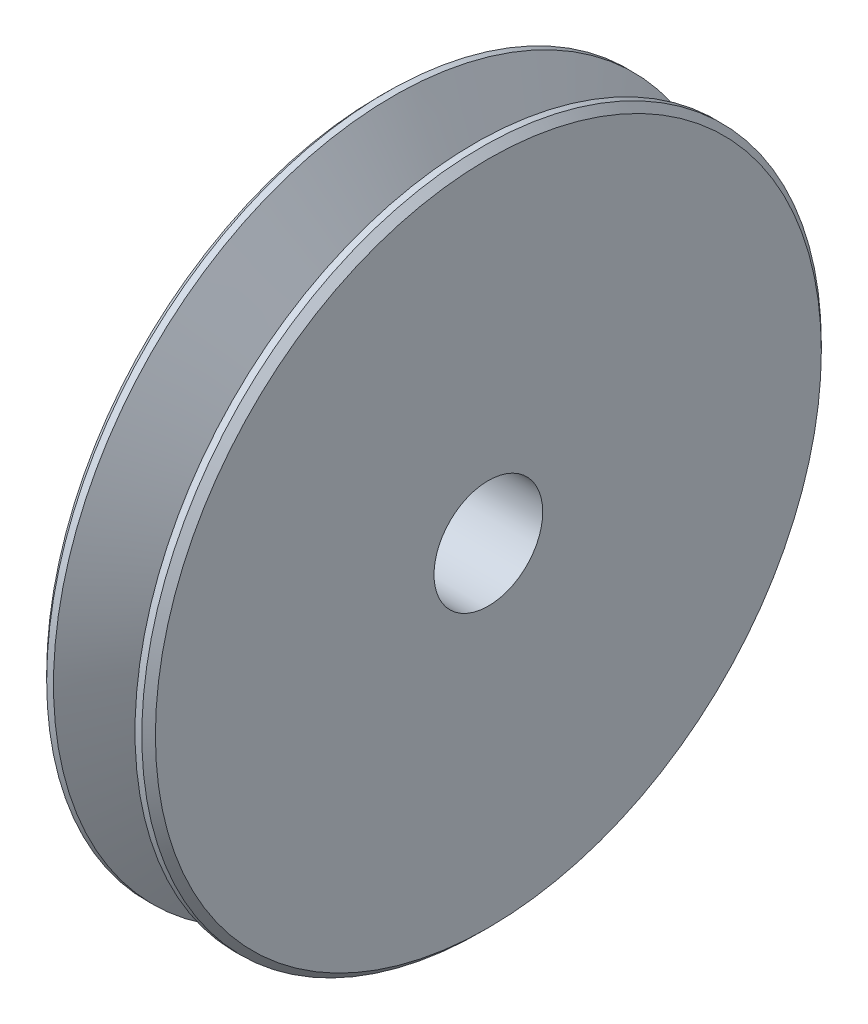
ISO-10303-21;
HEADER;
FILE_DESCRIPTION(('STEP AP214'),'2;1');
FILE_NAME('part.step','',(''),(''),'','','');
FILE_SCHEMA(('AUTOMOTIVE_DESIGN { 1 0 10303 214 1 1 1 1 }'));
ENDSEC;
DATA;
#1=APPLICATION_CONTEXT('core data for automotive mechanical design processes');
#2=APPLICATION_PROTOCOL_DEFINITION('international standard','automotive_design',2000,#1);
#3=PRODUCT_CONTEXT('',#1,'mechanical');
#4=PRODUCT('Part','Part','',(#3));
#5=PRODUCT_RELATED_PRODUCT_CATEGORY('part','',(#4));
#6=PRODUCT_DEFINITION_FORMATION('','',#4);
#7=PRODUCT_DEFINITION_CONTEXT('part definition',#1,'design');
#8=PRODUCT_DEFINITION('design','',#6,#7);
#9=PRODUCT_DEFINITION_SHAPE('','',#8);
#10=(LENGTH_UNIT() NAMED_UNIT(*) SI_UNIT(.MILLI.,.METRE.));
#11=(NAMED_UNIT(*) PLANE_ANGLE_UNIT() SI_UNIT($,.RADIAN.));
#12=(NAMED_UNIT(*) SI_UNIT($,.STERADIAN.) SOLID_ANGLE_UNIT());
#13=UNCERTAINTY_MEASURE_WITH_UNIT(LENGTH_MEASURE(1.E-05),#10,'distance_accuracy_value','');
#14=(GEOMETRIC_REPRESENTATION_CONTEXT(3) GLOBAL_UNCERTAINTY_ASSIGNED_CONTEXT((#13)) GLOBAL_UNIT_ASSIGNED_CONTEXT((#10,
#11,#12)) REPRESENTATION_CONTEXT('',''));
#15=CARTESIAN_POINT('',(0.,0.,0.));
#16=DIRECTION('',(0.,0.,1.));
#17=DIRECTION('',(1.,0.,0.));
#18=AXIS2_PLACEMENT_3D('',#15,#16,#17);
#19=CARTESIAN_POINT('',(0.,5.00000000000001,0.));
#20=DIRECTION('',(-1.,0.,0.));
#21=DIRECTION('',(0.,0.,1.));
#22=AXIS2_PLACEMENT_3D('',#19,#20,#21);
#23=PLANE('',#22);
#24=CARTESIAN_POINT('',(0.,0.,0.));
#25=DIRECTION('',(-1.,0.,0.));
#26=DIRECTION('',(0.,0.,1.));
#27=AXIS2_PLACEMENT_3D('',#24,#25,#26);
#28=CIRCLE('',#27,7.);
#29=CARTESIAN_POINT('',(0.,0.,7.));
#30=VERTEX_POINT('',#29);
#31=EDGE_CURVE('E11',#30,#30,#28,.F.);
#32=ORIENTED_EDGE('',*,*,#31,.T.);
#33=EDGE_LOOP('',(#32));
#34=FACE_BOUND('',#33,.T.);
#35=CARTESIAN_POINT('',(0.,-13.5,0.));
#36=DIRECTION('',(-1.,0.,0.));
#37=DIRECTION('',(0.,0.,1.));
#38=AXIS2_PLACEMENT_3D('',#35,#36,#37);
#39=CIRCLE('',#38,4.05);
#40=CARTESIAN_POINT('',(0.,-13.5,4.05));
#41=VERTEX_POINT('',#40);
#42=EDGE_CURVE('E76',#41,#41,#39,.T.);
#43=ORIENTED_EDGE('',*,*,#42,.F.);
#44=EDGE_LOOP('',(#43));
#45=FACE_BOUND('',#44,.T.);
#46=CARTESIAN_POINT('',(0.,13.5,0.));
#47=DIRECTION('',(-1.,0.,0.));
#48=DIRECTION('',(0.,0.,1.));
#49=AXIS2_PLACEMENT_3D('',#46,#47,#48);
#50=CIRCLE('',#49,4.05);
#51=CARTESIAN_POINT('',(0.,13.5,4.05));
#52=VERTEX_POINT('',#51);
#53=EDGE_CURVE('E82',#52,#52,#50,.T.);
#54=ORIENTED_EDGE('',*,*,#53,.F.);
#55=EDGE_LOOP('',(#54));
#56=FACE_BOUND('',#55,.T.);
#57=CARTESIAN_POINT('',(0.,0.,0.));
#58=DIRECTION('',(-1.,0.,0.));
#59=DIRECTION('',(0.,0.,1.));
#60=AXIS2_PLACEMENT_3D('',#57,#58,#59);
#61=CIRCLE('',#60,24.5);
#62=CARTESIAN_POINT('',(0.,0.,24.5));
#63=VERTEX_POINT('',#62);
#64=EDGE_CURVE('E110',#63,#63,#61,.T.);
#65=ORIENTED_EDGE('',*,*,#64,.T.);
#66=EDGE_LOOP('',(#65));
#67=FACE_BOUND('',#66,.T.);
#68=ADVANCED_FACE('F45',(#34,#45,#56,#67),#23,.T.);
#69=CARTESIAN_POINT('',(0.,0.,0.));
#70=DIRECTION('',(1.,0.,0.));
#71=DIRECTION('',(0.,0.,-1.));
#72=AXIS2_PLACEMENT_3D('',#69,#70,#71);
#73=CYLINDRICAL_SURFACE('',#72,25.);
#74=CARTESIAN_POINT('',(0.500000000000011,0.,0.));
#75=DIRECTION('',(-1.,0.,0.));
#76=DIRECTION('',(0.,0.,1.));
#77=AXIS2_PLACEMENT_3D('',#74,#75,#76);
#78=CIRCLE('',#77,25.);
#79=CARTESIAN_POINT('',(0.500000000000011,0.,25.));
#80=VERTEX_POINT('',#79);
#81=EDGE_CURVE('E106',#80,#80,#78,.F.);
#82=ORIENTED_EDGE('',*,*,#81,.T.);
#83=EDGE_LOOP('',(#82));
#84=FACE_BOUND('',#83,.T.);
#85=CARTESIAN_POINT('',(1.00000000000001,0.,0.));
#86=DIRECTION('',(1.,0.,0.));
#87=DIRECTION('',(0.,0.,-1.));
#88=AXIS2_PLACEMENT_3D('',#85,#86,#87);
#89=CIRCLE('',#88,25.);
#90=CARTESIAN_POINT('',(1.00000000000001,0.,-25.));
#91=VERTEX_POINT('',#90);
#92=EDGE_CURVE('E94',#91,#91,#89,.T.);
#93=ORIENTED_EDGE('',*,*,#92,.F.);
#94=EDGE_LOOP('',(#93));
#95=FACE_BOUND('',#94,.T.);
#96=ADVANCED_FACE('F47',(#84,#95),#73,.T.);
#97=CARTESIAN_POINT('',(8.00000000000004,5.00000000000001,0.));
#98=DIRECTION('',(1.,0.,0.));
#99=DIRECTION('',(0.,0.,-1.));
#100=AXIS2_PLACEMENT_3D('',#97,#98,#99);
#101=PLANE('',#100);
#102=CARTESIAN_POINT('',(8.00000000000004,0.,0.));
#103=DIRECTION('',(1.,0.,0.));
#104=DIRECTION('',(0.,0.,-1.));
#105=AXIS2_PLACEMENT_3D('',#102,#103,#104);
#106=CIRCLE('',#105,24.5);
#107=CARTESIAN_POINT('',(8.00000000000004,0.,-24.5));
#108=VERTEX_POINT('',#107);
#109=EDGE_CURVE('E114',#108,#108,#106,.T.);
#110=ORIENTED_EDGE('',*,*,#109,.T.);
#111=EDGE_LOOP('',(#110));
#112=FACE_BOUND('',#111,.T.);
#113=CARTESIAN_POINT('',(8.00000000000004,0.,0.));
#114=DIRECTION('',(1.,0.,0.));
#115=DIRECTION('',(0.,0.,-1.));
#116=AXIS2_PLACEMENT_3D('',#113,#114,#115);
#117=CIRCLE('',#116,4.);
#118=CARTESIAN_POINT('',(8.00000000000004,0.,-4.));
#119=VERTEX_POINT('',#118);
#120=EDGE_CURVE('E86',#119,#119,#117,.T.);
#121=ORIENTED_EDGE('',*,*,#120,.F.);
#122=EDGE_LOOP('',(#121));
#123=FACE_BOUND('',#122,.T.);
#124=ADVANCED_FACE('F151',(#112,#123),#101,.T.);
#125=CARTESIAN_POINT('',(0.,0.,0.));
#126=DIRECTION('',(1.,0.,0.));
#127=DIRECTION('',(0.,0.,-1.));
#128=AXIS2_PLACEMENT_3D('',#125,#126,#127);
#129=CYLINDRICAL_SURFACE('',#128,25.);
#130=CARTESIAN_POINT('',(7.50000000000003,0.,0.));
#131=DIRECTION('',(1.,0.,0.));
#132=DIRECTION('',(0.,0.,-1.));
#133=AXIS2_PLACEMENT_3D('',#130,#131,#132);
#134=CIRCLE('',#133,25.);
#135=CARTESIAN_POINT('',(7.50000000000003,0.,-25.));
#136=VERTEX_POINT('',#135);
#137=EDGE_CURVE('E118',#136,#136,#134,.F.);
#138=ORIENTED_EDGE('',*,*,#137,.T.);
#139=EDGE_LOOP('',(#138));
#140=FACE_BOUND('',#139,.T.);
#141=CARTESIAN_POINT('',(7.00000000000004,0.,0.));
#142=DIRECTION('',(1.,0.,0.));
#143=DIRECTION('',(0.,0.,-1.));
#144=AXIS2_PLACEMENT_3D('',#141,#142,#143);
#145=CIRCLE('',#144,25.);
#146=CARTESIAN_POINT('',(7.00000000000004,0.,-25.));
#147=VERTEX_POINT('',#146);
#148=EDGE_CURVE('E102',#147,#147,#145,.T.);
#149=ORIENTED_EDGE('',*,*,#148,.T.);
#150=EDGE_LOOP('',(#149));
#151=FACE_BOUND('',#150,.T.);
#152=ADVANCED_FACE('F156',(#140,#151),#129,.T.);
#153=CARTESIAN_POINT('',(7.00000000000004,0.,0.));
#154=DIRECTION('',(1.,0.,0.));
#155=DIRECTION('',(0.,0.,-1.));
#156=AXIS2_PLACEMENT_3D('',#153,#154,#155);
#157=CONICAL_SURFACE('',#156,25.,1.0471975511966);
#158=CARTESIAN_POINT('',(4.00000000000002,0.,0.));
#159=DIRECTION('',(1.,0.,0.));
#160=DIRECTION('',(0.,0.,-1.));
#161=AXIS2_PLACEMENT_3D('',#158,#159,#160);
#162=CIRCLE('',#161,19.8038475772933);
#163=CARTESIAN_POINT('',(4.00000000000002,0.,-19.8038475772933));
#164=VERTEX_POINT('',#163);
#165=EDGE_CURVE('E98',#164,#164,#162,.T.);
#166=ORIENTED_EDGE('',*,*,#165,.T.);
#167=EDGE_LOOP('',(#166));
#168=FACE_BOUND('',#167,.T.);
#169=ORIENTED_EDGE('',*,*,#148,.F.);
#170=EDGE_LOOP('',(#169));
#171=FACE_BOUND('',#170,.T.);
#172=ADVANCED_FACE('F159',(#168,#171),#157,.T.);
#173=CARTESIAN_POINT('',(4.00000000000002,0.,0.));
#174=DIRECTION('',(-1.,0.,0.));
#175=DIRECTION('',(0.,0.,1.));
#176=AXIS2_PLACEMENT_3D('',#173,#174,#175);
#177=CONICAL_SURFACE('',#176,19.8038475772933,1.0471975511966);
#178=ORIENTED_EDGE('',*,*,#92,.T.);
#179=EDGE_LOOP('',(#178));
#180=FACE_BOUND('',#179,.T.);
#181=ORIENTED_EDGE('',*,*,#165,.F.);
#182=EDGE_LOOP('',(#181));
#183=FACE_BOUND('',#182,.T.);
#184=ADVANCED_FACE('F163',(#180,#183),#177,.T.);
#185=CARTESIAN_POINT('',(-6.,0.,0.));
#186=DIRECTION('',(1.,0.,0.));
#187=DIRECTION('',(0.,0.,-1.));
#188=AXIS2_PLACEMENT_3D('',#185,#186,#187);
#189=CYLINDRICAL_SURFACE('',#188,6.);
#190=CARTESIAN_POINT('',(-1.00000000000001,0.,0.));
#191=DIRECTION('',(-1.,0.,0.));
#192=DIRECTION('',(0.,0.,1.));
#193=AXIS2_PLACEMENT_3D('',#190,#191,#192);
#194=CIRCLE('',#193,6.);
#195=CARTESIAN_POINT('',(-1.00000000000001,0.,6.));
#196=VERTEX_POINT('',#195);
#197=EDGE_CURVE('E54',#196,#196,#194,.T.);
#198=ORIENTED_EDGE('',*,*,#197,.T.);
#199=EDGE_LOOP('',(#198));
#200=FACE_BOUND('',#199,.T.);
#201=CARTESIAN_POINT('',(-5.5,0.,0.));
#202=DIRECTION('',(-1.,0.,0.));
#203=DIRECTION('',(0.,0.,1.));
#204=AXIS2_PLACEMENT_3D('',#201,#202,#203);
#205=CIRCLE('',#204,6.);
#206=CARTESIAN_POINT('',(-5.5,0.,6.));
#207=VERTEX_POINT('',#206);
#208=EDGE_CURVE('E126',#207,#207,#205,.F.);
#209=ORIENTED_EDGE('',*,*,#208,.T.);
#210=EDGE_LOOP('',(#209));
#211=FACE_BOUND('',#210,.T.);
#212=ADVANCED_FACE('F134',(#200,#211),#189,.T.);
#213=CARTESIAN_POINT('',(-6.,0.,0.));
#214=DIRECTION('',(-1.,0.,0.));
#215=DIRECTION('',(0.,0.,1.));
#216=AXIS2_PLACEMENT_3D('',#213,#214,#215);
#217=PLANE('',#216);
#218=CARTESIAN_POINT('',(-6.,0.,0.));
#219=DIRECTION('',(-1.,0.,0.));
#220=DIRECTION('',(0.,0.,1.));
#221=AXIS2_PLACEMENT_3D('',#218,#219,#220);
#222=CIRCLE('',#221,5.5);
#223=CARTESIAN_POINT('',(-6.,0.,5.5));
#224=VERTEX_POINT('',#223);
#225=EDGE_CURVE('E122',#224,#224,#222,.T.);
#226=ORIENTED_EDGE('',*,*,#225,.T.);
#227=EDGE_LOOP('',(#226));
#228=FACE_BOUND('',#227,.T.);
#229=CARTESIAN_POINT('',(-5.99999999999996,0.,0.));
#230=DIRECTION('',(1.,0.,0.));
#231=DIRECTION('',(0.,0.,-1.));
#232=AXIS2_PLACEMENT_3D('',#229,#230,#231);
#233=CIRCLE('',#232,4.);
#234=CARTESIAN_POINT('',(-5.99999999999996,0.,-4.));
#235=VERTEX_POINT('',#234);
#236=EDGE_CURVE('E90',#235,#235,#233,.T.);
#237=ORIENTED_EDGE('',*,*,#236,.T.);
#238=EDGE_LOOP('',(#237));
#239=FACE_BOUND('',#238,.T.);
#240=ADVANCED_FACE('F170',(#228,#239),#217,.T.);
#241=CARTESIAN_POINT('',(0.500000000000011,0.,0.));
#242=DIRECTION('',(1.,0.,0.));
#243=DIRECTION('',(0.,0.,-1.));
#244=AXIS2_PLACEMENT_3D('',#241,#242,#243);
#245=CONICAL_SURFACE('',#244,25.,0.785398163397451);
#246=ORIENTED_EDGE('',*,*,#64,.F.);
#247=EDGE_LOOP('',(#246));
#248=FACE_BOUND('',#247,.T.);
#249=ORIENTED_EDGE('',*,*,#81,.F.);
#250=EDGE_LOOP('',(#249));
#251=FACE_BOUND('',#250,.T.);
#252=ADVANCED_FACE('F173',(#248,#251),#245,.T.);
#253=CARTESIAN_POINT('',(8.00000000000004,0.,0.));
#254=DIRECTION('',(-1.,0.,0.));
#255=DIRECTION('',(0.,0.,1.));
#256=AXIS2_PLACEMENT_3D('',#253,#254,#255);
#257=CONICAL_SURFACE('',#256,24.5,0.785398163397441);
#258=ORIENTED_EDGE('',*,*,#137,.F.);
#259=EDGE_LOOP('',(#258));
#260=FACE_BOUND('',#259,.T.);
#261=ORIENTED_EDGE('',*,*,#109,.F.);
#262=EDGE_LOOP('',(#261));
#263=FACE_BOUND('',#262,.T.);
#264=ADVANCED_FACE('F183',(#260,#263),#257,.T.);
#265=CARTESIAN_POINT('',(-6.,0.,0.));
#266=DIRECTION('',(1.,0.,0.));
#267=DIRECTION('',(0.,0.,-1.));
#268=AXIS2_PLACEMENT_3D('',#265,#266,#267);
#269=CONICAL_SURFACE('',#268,5.5,0.785398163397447);
#270=ORIENTED_EDGE('',*,*,#208,.F.);
#271=EDGE_LOOP('',(#270));
#272=FACE_BOUND('',#271,.T.);
#273=ORIENTED_EDGE('',*,*,#225,.F.);
#274=EDGE_LOOP('',(#273));
#275=FACE_BOUND('',#274,.T.);
#276=ADVANCED_FACE('F179',(#272,#275),#269,.T.);
#277=CARTESIAN_POINT('',(8.00000000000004,0.,0.));
#278=DIRECTION('',(-1.,0.,0.));
#279=DIRECTION('',(0.,0.,1.));
#280=AXIS2_PLACEMENT_3D('',#277,#278,#279);
#281=CYLINDRICAL_SURFACE('',#280,4.);
#282=ORIENTED_EDGE('',*,*,#236,.F.);
#283=EDGE_LOOP('',(#282));
#284=FACE_BOUND('',#283,.T.);
#285=ORIENTED_EDGE('',*,*,#120,.T.);
#286=EDGE_LOOP('',(#285));
#287=FACE_BOUND('',#286,.T.);
#288=ADVANCED_FACE('F175',(#284,#287),#281,.F.);
#289=CARTESIAN_POINT('',(4.,13.5,0.));
#290=DIRECTION('',(-1.,0.,0.));
#291=DIRECTION('',(0.,0.,1.));
#292=AXIS2_PLACEMENT_3D('',#289,#290,#291);
#293=CYLINDRICAL_SURFACE('',#292,4.05);
#294=CARTESIAN_POINT('',(4.,13.5,0.));
#295=DIRECTION('',(-1.,0.,0.));
#296=DIRECTION('',(0.,0.,1.));
#297=AXIS2_PLACEMENT_3D('',#294,#295,#296);
#298=CIRCLE('',#297,4.05);
#299=CARTESIAN_POINT('',(4.,13.5,4.05));
#300=VERTEX_POINT('',#299);
#301=EDGE_CURVE('E68',#300,#300,#298,.T.);
#302=ORIENTED_EDGE('',*,*,#301,.F.);
#303=EDGE_LOOP('',(#302));
#304=FACE_BOUND('',#303,.T.);
#305=ORIENTED_EDGE('',*,*,#53,.T.);
#306=EDGE_LOOP('',(#305));
#307=FACE_BOUND('',#306,.T.);
#308=ADVANCED_FACE('F178',(#304,#307),#293,.F.);
#309=CARTESIAN_POINT('',(4.,-13.5,0.));
#310=DIRECTION('',(-1.,0.,0.));
#311=DIRECTION('',(0.,0.,1.));
#312=AXIS2_PLACEMENT_3D('',#309,#310,#311);
#313=CYLINDRICAL_SURFACE('',#312,4.05);
#314=CARTESIAN_POINT('',(4.,-13.5,0.));
#315=DIRECTION('',(-1.,0.,0.));
#316=DIRECTION('',(0.,0.,1.));
#317=AXIS2_PLACEMENT_3D('',#314,#315,#316);
#318=CIRCLE('',#317,4.05);
#319=CARTESIAN_POINT('',(4.,-13.5,4.05));
#320=VERTEX_POINT('',#319);
#321=EDGE_CURVE('E71',#320,#320,#318,.T.);
#322=ORIENTED_EDGE('',*,*,#321,.F.);
#323=EDGE_LOOP('',(#322));
#324=FACE_BOUND('',#323,.T.);
#325=ORIENTED_EDGE('',*,*,#42,.T.);
#326=EDGE_LOOP('',(#325));
#327=FACE_BOUND('',#326,.T.);
#328=ADVANCED_FACE('F192',(#324,#327),#313,.F.);
#329=CARTESIAN_POINT('',(4.,-13.5,0.));
#330=DIRECTION('',(-1.,0.,0.));
#331=DIRECTION('',(0.,0.,1.));
#332=AXIS2_PLACEMENT_3D('',#329,#330,#331);
#333=CONICAL_SURFACE('',#332,4.05,1.0471975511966);
#334=CARTESIAN_POINT('',(6.33826859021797,-13.5,0.));
#335=VERTEX_POINT('',#334);
#336=VERTEX_LOOP('',#335);
#337=FACE_BOUND('',#336,.T.);
#338=ORIENTED_EDGE('',*,*,#321,.T.);
#339=EDGE_LOOP('',(#338));
#340=FACE_BOUND('',#339,.T.);
#341=ADVANCED_FACE('F64',(#337,#340),#333,.F.);
#342=CARTESIAN_POINT('',(4.,13.5,0.));
#343=DIRECTION('',(-1.,0.,0.));
#344=DIRECTION('',(0.,0.,1.));
#345=AXIS2_PLACEMENT_3D('',#342,#343,#344);
#346=CONICAL_SURFACE('',#345,4.05,1.0471975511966);
#347=CARTESIAN_POINT('',(6.33826859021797,13.5,0.));
#348=VERTEX_POINT('',#347);
#349=VERTEX_LOOP('',#348);
#350=FACE_BOUND('',#349,.T.);
#351=ORIENTED_EDGE('',*,*,#301,.T.);
#352=EDGE_LOOP('',(#351));
#353=FACE_BOUND('',#352,.T.);
#354=ADVANCED_FACE('F60',(#350,#353),#346,.F.);
#355=CARTESIAN_POINT('',(-1.00000000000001,0.,0.));
#356=DIRECTION('',(1.,0.,0.));
#357=DIRECTION('',(0.,0.,-1.));
#358=AXIS2_PLACEMENT_3D('',#355,#356,#357);
#359=CONICAL_SURFACE('',#358,6.,0.785398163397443);
#360=ORIENTED_EDGE('',*,*,#31,.F.);
#361=EDGE_LOOP('',(#360));
#362=FACE_BOUND('',#361,.T.);
#363=ORIENTED_EDGE('',*,*,#197,.F.);
#364=EDGE_LOOP('',(#363));
#365=FACE_BOUND('',#364,.T.);
#366=ADVANCED_FACE('F63',(#362,#365),#359,.T.);
#367=CLOSED_SHELL('',(#68,#96,#124,#152,#172,#184,#212,#240,#252,#264,#276,#288,#308,#328,#341,
#354,#366));
#368=MANIFOLD_SOLID_BREP('B2',#367);
#369=ADVANCED_BREP_SHAPE_REPRESENTATION('',(#18,#368),#14);
#370=SHAPE_DEFINITION_REPRESENTATION(#9,#369);
ENDSEC;
END-ISO-10303-21;
